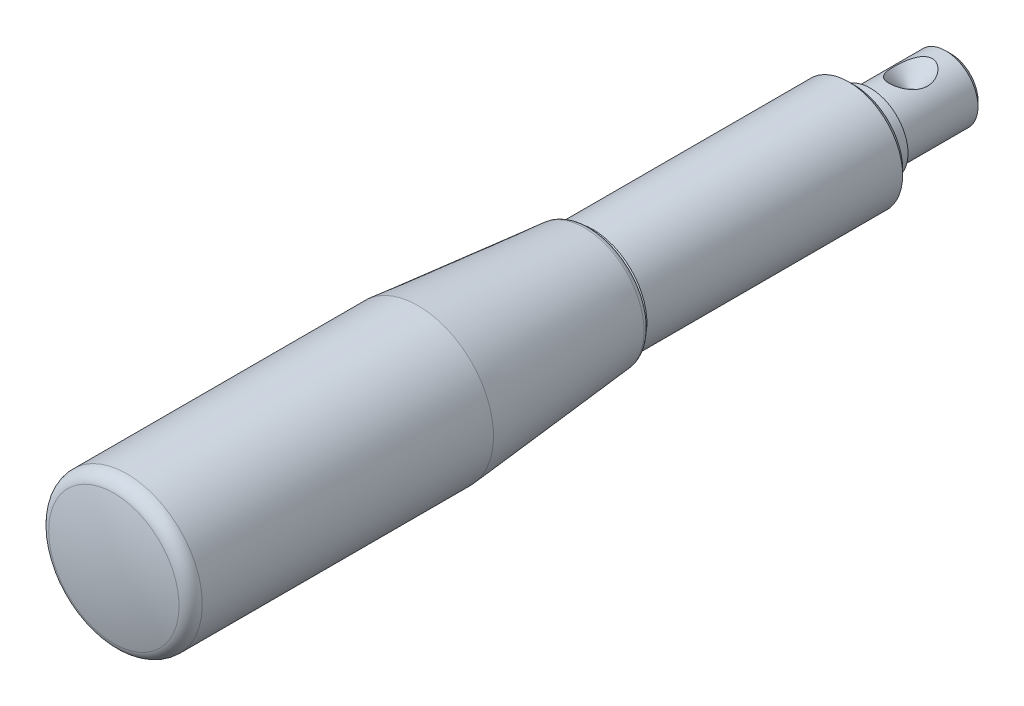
ISO-10303-21;
HEADER;
FILE_DESCRIPTION(('STEP AP214'),'2;1');
FILE_NAME('part.step','',(''),(''),'','','');
FILE_SCHEMA(('AUTOMOTIVE_DESIGN { 1 0 10303 214 1 1 1 1 }'));
ENDSEC;
DATA;
#1=APPLICATION_CONTEXT('core data for automotive mechanical design processes');
#2=APPLICATION_PROTOCOL_DEFINITION('international standard','automotive_design',2000,#1);
#3=PRODUCT_CONTEXT('',#1,'mechanical');
#4=PRODUCT('Part','Part','',(#3));
#5=PRODUCT_RELATED_PRODUCT_CATEGORY('part','',(#4));
#6=PRODUCT_DEFINITION_FORMATION('','',#4);
#7=PRODUCT_DEFINITION_CONTEXT('part definition',#1,'design');
#8=PRODUCT_DEFINITION('design','',#6,#7);
#9=PRODUCT_DEFINITION_SHAPE('','',#8);
#10=(LENGTH_UNIT() NAMED_UNIT(*) SI_UNIT(.MILLI.,.METRE.));
#11=(NAMED_UNIT(*) PLANE_ANGLE_UNIT() SI_UNIT($,.RADIAN.));
#12=(NAMED_UNIT(*) SI_UNIT($,.STERADIAN.) SOLID_ANGLE_UNIT());
#13=UNCERTAINTY_MEASURE_WITH_UNIT(LENGTH_MEASURE(1.E-05),#10,'distance_accuracy_value','');
#14=(GEOMETRIC_REPRESENTATION_CONTEXT(3) GLOBAL_UNCERTAINTY_ASSIGNED_CONTEXT((#13)) GLOBAL_UNIT_ASSIGNED_CONTEXT((#10,
#11,#12)) REPRESENTATION_CONTEXT('',''));
#15=CARTESIAN_POINT('',(0.,0.,0.));
#16=DIRECTION('',(0.,0.,1.));
#17=DIRECTION('',(1.,0.,0.));
#18=AXIS2_PLACEMENT_3D('',#15,#16,#17);
#19=CARTESIAN_POINT('',(0.,0.,51.5));
#20=DIRECTION('',(0.,0.,-1.));
#21=DIRECTION('',(-1.,0.,0.));
#22=AXIS2_PLACEMENT_3D('',#19,#20,#21);
#23=CONICAL_SURFACE('',#22,10.,0.785398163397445);
#24=CARTESIAN_POINT('',(0.,0.,52.));
#25=DIRECTION('',(0.,0.,1.));
#26=DIRECTION('',(-1.,0.,0.));
#27=AXIS2_PLACEMENT_3D('',#24,#25,#26);
#28=CIRCLE('',#27,9.5);
#29=CARTESIAN_POINT('',(-9.5,0.,52.));
#30=VERTEX_POINT('',#29);
#31=EDGE_CURVE('E8',#30,#30,#28,.T.);
#32=ORIENTED_EDGE('',*,*,#31,.F.);
#33=EDGE_LOOP('',(#32));
#34=FACE_BOUND('',#33,.T.);
#35=CARTESIAN_POINT('',(0.,0.,51.5));
#36=DIRECTION('',(0.,0.,-1.));
#37=DIRECTION('',(-1.,0.,0.));
#38=AXIS2_PLACEMENT_3D('',#35,#36,#37);
#39=CIRCLE('',#38,10.);
#40=CARTESIAN_POINT('',(-10.,0.,51.5));
#41=VERTEX_POINT('',#40);
#42=EDGE_CURVE('E54',#41,#41,#39,.T.);
#43=ORIENTED_EDGE('',*,*,#42,.F.);
#44=EDGE_LOOP('',(#43));
#45=FACE_BOUND('',#44,.T.);
#46=ADVANCED_FACE('F12',(#34,#45),#23,.T.);
#47=CARTESIAN_POINT('',(0.,0.,-15.));
#48=DIRECTION('',(0.,0.,-1.));
#49=DIRECTION('',(-1.,0.,0.));
#50=AXIS2_PLACEMENT_3D('',#47,#48,#49);
#51=CYLINDRICAL_SURFACE('',#50,10.);
#52=CARTESIAN_POINT('',(0.,0.,4.));
#53=DIRECTION('',(0.,0.,1.));
#54=DIRECTION('',(1.,0.,0.));
#55=AXIS2_PLACEMENT_3D('',#52,#53,#54);
#56=CIRCLE('',#55,10.);
#57=CARTESIAN_POINT('',(10.,0.,4.));
#58=VERTEX_POINT('',#57);
#59=EDGE_CURVE('E16',#58,#58,#56,.T.);
#60=ORIENTED_EDGE('',*,*,#59,.T.);
#61=EDGE_LOOP('',(#60));
#62=FACE_BOUND('',#61,.T.);
#63=ORIENTED_EDGE('',*,*,#42,.T.);
#64=EDGE_LOOP('',(#63));
#65=FACE_BOUND('',#64,.T.);
#66=ADVANCED_FACE('F74',(#62,#65),#51,.T.);
#67=CARTESIAN_POINT('',(0.,0.,3.));
#68=DIRECTION('',(0.,0.,1.));
#69=DIRECTION('',(1.,0.,0.));
#70=AXIS2_PLACEMENT_3D('',#67,#68,#69);
#71=CONICAL_SURFACE('',#70,9.,0.785398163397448);
#72=ORIENTED_EDGE('',*,*,#59,.F.);
#73=EDGE_LOOP('',(#72));
#74=FACE_BOUND('',#73,.T.);
#75=CARTESIAN_POINT('',(0.,0.,3.));
#76=DIRECTION('',(0.,0.,1.));
#77=DIRECTION('',(1.,0.,0.));
#78=AXIS2_PLACEMENT_3D('',#75,#76,#77);
#79=CIRCLE('',#78,9.);
#80=CARTESIAN_POINT('',(9.,0.,3.));
#81=VERTEX_POINT('',#80);
#82=EDGE_CURVE('E137',#81,#81,#79,.F.);
#83=ORIENTED_EDGE('',*,*,#82,.F.);
#84=EDGE_LOOP('',(#83));
#85=FACE_BOUND('',#84,.T.);
#86=ADVANCED_FACE('F77',(#74,#85),#71,.T.);
#87=CARTESIAN_POINT('',(0.,7.,3.));
#88=DIRECTION('',(0.,0.,1.));
#89=DIRECTION('',(1.,0.,0.));
#90=AXIS2_PLACEMENT_3D('',#87,#88,#89);
#91=PLANE('',#90);
#92=ORIENTED_EDGE('',*,*,#82,.T.);
#93=EDGE_LOOP('',(#92));
#94=FACE_BOUND('',#93,.T.);
#95=CARTESIAN_POINT('',(0.,0.,3.));
#96=DIRECTION('',(0.,0.,-1.));
#97=DIRECTION('',(-1.,0.,0.));
#98=AXIS2_PLACEMENT_3D('',#95,#96,#97);
#99=CIRCLE('',#98,7.);
#100=CARTESIAN_POINT('',(-7.,0.,3.));
#101=VERTEX_POINT('',#100);
#102=EDGE_CURVE('E32',#101,#101,#99,.T.);
#103=ORIENTED_EDGE('',*,*,#102,.F.);
#104=EDGE_LOOP('',(#103));
#105=FACE_BOUND('',#104,.T.);
#106=ADVANCED_FACE('F79',(#94,#105),#91,.F.);
#107=CARTESIAN_POINT('',(0.,0.,-15.));
#108=DIRECTION('',(0.,0.,-1.));
#109=DIRECTION('',(-1.,0.,0.));
#110=AXIS2_PLACEMENT_3D('',#107,#108,#109);
#111=CYLINDRICAL_SURFACE('',#110,7.);
#112=CARTESIAN_POINT('',(0.,0.,0.));
#113=DIRECTION('',(0.,0.,-1.));
#114=DIRECTION('',(-1.,0.,0.));
#115=AXIS2_PLACEMENT_3D('',#112,#113,#114);
#116=CIRCLE('',#115,7.);
#117=CARTESIAN_POINT('',(-7.,0.,0.));
#118=VERTEX_POINT('',#117);
#119=EDGE_CURVE('E35',#118,#118,#116,.T.);
#120=ORIENTED_EDGE('',*,*,#119,.F.);
#121=EDGE_LOOP('',(#120));
#122=FACE_BOUND('',#121,.T.);
#123=ORIENTED_EDGE('',*,*,#102,.T.);
#124=EDGE_LOOP('',(#123));
#125=FACE_BOUND('',#124,.T.);
#126=ADVANCED_FACE('F82',(#122,#125),#111,.T.);
#127=CARTESIAN_POINT('',(0.,6.,0.));
#128=DIRECTION('',(0.,0.,1.));
#129=DIRECTION('',(1.,0.,0.));
#130=AXIS2_PLACEMENT_3D('',#127,#128,#129);
#131=PLANE('',#130);
#132=CARTESIAN_POINT('',(0.,0.,0.));
#133=DIRECTION('',(0.,0.,-1.));
#134=DIRECTION('',(-1.,0.,0.));
#135=AXIS2_PLACEMENT_3D('',#132,#133,#134);
#136=CIRCLE('',#135,6.);
#137=CARTESIAN_POINT('',(-6.,0.,0.));
#138=VERTEX_POINT('',#137);
#139=EDGE_CURVE('E38',#138,#138,#136,.T.);
#140=ORIENTED_EDGE('',*,*,#139,.F.);
#141=EDGE_LOOP('',(#140));
#142=FACE_BOUND('',#141,.T.);
#143=ORIENTED_EDGE('',*,*,#119,.T.);
#144=EDGE_LOOP('',(#143));
#145=FACE_BOUND('',#144,.T.);
#146=ADVANCED_FACE('F85',(#142,#145),#131,.F.);
#147=CARTESIAN_POINT('',(0.,0.,-15.));
#148=DIRECTION('',(0.,0.,-1.));
#149=DIRECTION('',(-1.,0.,0.));
#150=AXIS2_PLACEMENT_3D('',#147,#148,#149);
#151=CYLINDRICAL_SURFACE('',#150,6.);
#152=ORIENTED_EDGE('',*,*,#139,.T.);
#153=EDGE_LOOP('',(#152));
#154=FACE_BOUND('',#153,.T.);
#155=CARTESIAN_POINT('',(0.,0.,-14.));
#156=DIRECTION('',(0.,0.,1.));
#157=DIRECTION('',(1.,0.,0.));
#158=AXIS2_PLACEMENT_3D('',#155,#156,#157);
#159=CIRCLE('',#158,6.);
#160=CARTESIAN_POINT('',(6.,0.,-14.));
#161=VERTEX_POINT('',#160);
#162=EDGE_CURVE('E44',#161,#161,#159,.T.);
#163=ORIENTED_EDGE('',*,*,#162,.T.);
#164=EDGE_LOOP('',(#163));
#165=FACE_BOUND('',#164,.T.);
#166=CARTESIAN_POINT('',(2.06147021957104,5.63474405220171,-10.4936106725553));
#167=CARTESIAN_POINT('',(1.94537926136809,5.67721716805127,-10.6251270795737));
#168=CARTESIAN_POINT('',(1.81952938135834,5.71921045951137,-10.7482867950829));
#169=CARTESIAN_POINT('',(1.54830243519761,5.79850237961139,-10.9728526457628));
#170=CARTESIAN_POINT('',(1.40294833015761,5.83580643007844,-11.0742840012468));
#171=CARTESIAN_POINT('',(1.13034003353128,5.89380613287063,-11.2285247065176));
#172=CARTESIAN_POINT('',(1.00678796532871,5.91634588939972,-11.2871571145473));
#173=CARTESIAN_POINT('',(0.751034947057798,5.95420838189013,-11.3845886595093));
#174=CARTESIAN_POINT('',(0.618842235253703,5.96953788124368,-11.4234063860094));
#175=CARTESIAN_POINT('',(0.348215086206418,5.99143199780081,-11.478608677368));
#176=CARTESIAN_POINT('',(0.209747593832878,5.9979427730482,-11.4948554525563));
#177=CARTESIAN_POINT('',(-0.0680197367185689,6.00122024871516,-11.5030519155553));
#178=CARTESIAN_POINT('',(-0.207319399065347,5.99798893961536,-11.4950065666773));
#179=CARTESIAN_POINT('',(-0.469445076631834,5.98291816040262,-11.4571641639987));
#180=CARTESIAN_POINT('',(-0.59262159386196,5.97188362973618,-11.4294001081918));
#181=CARTESIAN_POINT('',(-0.832760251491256,5.94316091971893,-11.3562416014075));
#182=CARTESIAN_POINT('',(-0.949719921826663,5.92547011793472,-11.3108402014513));
#183=CARTESIAN_POINT('',(-1.21214938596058,5.87824552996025,-11.1875521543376));
#184=CARTESIAN_POINT('',(-1.35455349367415,5.84673153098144,-11.1039047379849));
#185=CARTESIAN_POINT('',(-1.62301608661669,5.77798695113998,-10.9153838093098));
#186=CARTESIAN_POINT('',(-1.74904111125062,5.74074499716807,-10.8104679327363));
#187=CARTESIAN_POINT('',(-2.02193803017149,5.65141451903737,-10.5477020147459));
#188=CARTESIAN_POINT('',(-2.1625345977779,5.59839489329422,-10.3836662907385));
#189=CARTESIAN_POINT('',(-2.41482179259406,5.49429677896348,-10.0342746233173));
#190=CARTESIAN_POINT('',(-2.52648419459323,5.44322022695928,-9.84889811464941));
#191=CARTESIAN_POINT('',(-2.72331769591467,5.34749725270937,-9.45847220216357));
#192=CARTESIAN_POINT('',(-2.80794882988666,5.30299043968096,-9.25311744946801));
#193=CARTESIAN_POINT('',(-2.94771627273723,5.22660210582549,-8.83037053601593));
#194=CARTESIAN_POINT('',(-3.00286542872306,5.19471508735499,-8.61298366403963));
#195=CARTESIAN_POINT('',(-3.06529311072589,5.15796410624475,-8.26950199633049));
#196=CARTESIAN_POINT('',(-3.08295353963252,5.14738887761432,-8.14579741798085));
#197=CARTESIAN_POINT('',(-3.10896001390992,5.131726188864,-7.89703169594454));
#198=CARTESIAN_POINT('',(-3.1173054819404,5.12663906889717,-7.77197046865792));
#199=CARTESIAN_POINT('',(-3.12462160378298,5.12218263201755,-7.52148975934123));
#200=CARTESIAN_POINT('',(-3.12359315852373,5.12281276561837,-7.39607031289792));
#201=CARTESIAN_POINT('',(-3.11217336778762,5.12975841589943,-7.14582248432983));
#202=CARTESIAN_POINT('',(-3.10178234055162,5.13607373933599,-7.02099408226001));
#203=CARTESIAN_POINT('',(-3.07218852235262,5.15382830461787,-6.77693746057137));
#204=CARTESIAN_POINT('',(-3.05328675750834,5.16509220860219,-6.65766007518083));
#205=CARTESIAN_POINT('',(-3.00686932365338,5.19224858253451,-6.42132711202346));
#206=CARTESIAN_POINT('',(-2.97935042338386,5.20814278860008,-6.30427238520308));
#207=CARTESIAN_POINT('',(-2.88389914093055,5.26199320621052,-5.957309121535));
#208=CARTESIAN_POINT('',(-2.80307966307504,5.30611223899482,-5.73166354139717));
#209=CARTESIAN_POINT('',(-2.65506099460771,5.38087131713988,-5.40349202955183));
#210=CARTESIAN_POINT('',(-2.60023356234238,5.40768577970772,-5.29428155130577));
#211=CARTESIAN_POINT('',(-2.48153403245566,5.46317610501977,-5.08139350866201));
#212=CARTESIAN_POINT('',(-2.41766114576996,5.49185213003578,-4.97771642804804));
#213=CARTESIAN_POINT('',(-2.21246621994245,5.57916617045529,-4.6767269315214));
#214=CARTESIAN_POINT('',(-2.05727103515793,5.63925203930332,-4.48878358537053));
#215=CARTESIAN_POINT('',(-1.76960154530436,5.73435969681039,-4.20790207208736));
#216=CARTESIAN_POINT('',(-1.64770371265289,5.77088792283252,-4.10453373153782));
#217=CARTESIAN_POINT('',(-1.38819745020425,5.8387332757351,-3.91767011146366));
#218=CARTESIAN_POINT('',(-1.25061556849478,5.87005899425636,-3.83414196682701));
#219=CARTESIAN_POINT('',(-0.986314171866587,5.91963068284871,-3.70421286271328));
#220=CARTESIAN_POINT('',(-0.86177593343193,5.93919831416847,-3.65390190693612));
#221=CARTESIAN_POINT('',(-0.605405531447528,5.9707714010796,-3.57338945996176));
#222=CARTESIAN_POINT('',(-0.473578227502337,5.98278183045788,-3.54317474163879));
#223=CARTESIAN_POINT('',(-0.205565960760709,5.99798456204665,-3.50500812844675));
#224=CARTESIAN_POINT('',(-0.069363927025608,6.00113657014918,-3.49715796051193));
#225=CARTESIAN_POINT('',(0.202285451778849,5.9981272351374,-3.50468267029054));
#226=CARTESIAN_POINT('',(0.337732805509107,5.99196599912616,-3.52005728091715));
#227=CARTESIAN_POINT('',(0.593984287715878,5.97181215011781,-3.57084951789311));
#228=CARTESIAN_POINT('',(0.715142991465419,5.95841093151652,-3.60475558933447));
#229=CARTESIAN_POINT('',(0.950499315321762,5.92542833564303,-3.6893663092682));
#230=CARTESIAN_POINT('',(1.06469410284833,5.9058444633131,-3.74007774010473));
#231=CARTESIAN_POINT('',(1.32633534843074,5.85361082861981,-3.87789841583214));
#232=CARTESIAN_POINT('',(1.46992804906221,5.81882392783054,-3.9715161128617));
#233=CARTESIAN_POINT('',(1.73916518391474,5.74412210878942,-4.18013563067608));
#234=CARTESIAN_POINT('',(1.86476979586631,5.70419617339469,-4.29518363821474));
#235=CARTESIAN_POINT('',(2.13415284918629,5.60995918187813,-4.58042886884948));
#236=CARTESIAN_POINT('',(2.27135846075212,5.55504935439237,-4.75662892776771));
#237=CARTESIAN_POINT('',(2.515102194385,5.44903145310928,-5.12996296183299));
#238=CARTESIAN_POINT('',(2.62161483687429,5.39792656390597,-5.32711414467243));
#239=CARTESIAN_POINT('',(2.80590536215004,5.30450437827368,-5.7403787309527));
#240=CARTESIAN_POINT('',(2.88320422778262,5.26233817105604,-5.95674189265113));
#241=CARTESIAN_POINT('',(2.97549046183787,5.210341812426,-6.28932711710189));
#242=CARTESIAN_POINT('',(3.00231071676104,5.19488396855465,-6.4015433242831));
#243=CARTESIAN_POINT('',(3.04801412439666,5.16820289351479,-6.62806490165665));
#244=CARTESIAN_POINT('',(3.06689994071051,5.15697824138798,-6.74236955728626));
#245=CARTESIAN_POINT('',(3.0977572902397,5.13850635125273,-6.98083762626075));
#246=CARTESIAN_POINT('',(3.10911804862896,5.13161241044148,-7.10510776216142));
#247=CARTESIAN_POINT('',(3.12254643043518,5.12345257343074,-7.35434087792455));
#248=CARTESIAN_POINT('',(3.12461358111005,5.1221869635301,-7.47930389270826));
#249=CARTESIAN_POINT('',(3.11943868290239,5.125340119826,-7.72903714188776));
#250=CARTESIAN_POINT('',(3.11219126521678,5.12976216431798,-7.85380722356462));
#251=CARTESIAN_POINT('',(3.08842266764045,5.14410696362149,-8.10213246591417));
#252=CARTESIAN_POINT('',(3.07190181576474,5.15402952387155,-8.22568766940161));
#253=CARTESIAN_POINT('',(3.03029279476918,5.17859944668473,-8.4670687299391));
#254=CARTESIAN_POINT('',(3.00547290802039,5.19309814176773,-8.58495588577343));
#255=CARTESIAN_POINT('',(2.94726799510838,5.22634885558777,-8.81799553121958));
#256=CARTESIAN_POINT('',(2.91387925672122,5.24510271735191,-8.93314681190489));
#257=CARTESIAN_POINT('',(2.80103557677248,5.3067535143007,-9.27313714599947));
#258=CARTESIAN_POINT('',(2.70882184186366,5.35509218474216,-9.49298755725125));
#259=CARTESIAN_POINT('',(2.52578065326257,5.44307926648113,-9.84515798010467));
#260=CARTESIAN_POINT('',(2.44405294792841,5.48051978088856,-9.98288174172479));
#261=CARTESIAN_POINT('',(2.26473688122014,5.55702063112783,-10.2472495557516));
#262=CARTESIAN_POINT('',(2.1671468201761,5.59608114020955,-10.3738924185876));
#263=CARTESIAN_POINT('',(2.06147021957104,5.63474405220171,-10.4936106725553));
#264=B_SPLINE_CURVE_WITH_KNOTS('',3,(#166,#167,#168,#169,#170,#171,#172,#173,#174,#175,#176,
#177,#178,#179,#180,#181,#182,#183,#184,#185,#186,#187,#188,#189,#190,#191,#192,#193,#194,#195,
#196,#197,#198,#199,#200,#201,#202,#203,#204,#205,#206,#207,#208,#209,#210,#211,#212,#213,#214,
#215,#216,#217,#218,#219,#220,#221,#222,#223,#224,#225,#226,#227,#228,#229,#230,#231,#232,#233,
#234,#235,#236,#237,#238,#239,#240,#241,#242,#243,#244,#245,#246,#247,#248,#249,#250,#251,#252,
#253,#254,#255,#256,#257,#258,#259,#260,#261,#262,#263),.UNSPECIFIED.,.T.,.F.,(4,2,2,2,2,2,2,2,
2,2,2,2,2,2,2,2,2,2,2,2,2,2,2,2,2,2,2,2,2,2,2,2,2,2,2,2,2,2,2,2,2,2,2,2,2,2,2,2,4),(0.,
0.54103950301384,1.08144757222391,1.49563323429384,1.90942960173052,2.32574114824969,
2.74196764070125,3.12055118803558,3.49928404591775,4.00092641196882,4.50357798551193,
5.16742517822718,5.83191753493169,6.50895565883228,7.18569851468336,7.56150847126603,
7.93734171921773,8.31313884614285,8.68892319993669,9.05234932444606,9.4159118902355,
10.1432229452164,10.5181607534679,10.8931312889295,11.6408422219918,12.1310980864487,
12.6205360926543,13.026068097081,13.4313329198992,13.8384382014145,14.2455388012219,
14.6235338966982,15.0016817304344,15.5235233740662,16.0465029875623,16.7327929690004,
17.4196510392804,18.1173276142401,18.4662522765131,18.8150597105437,19.1895242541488,
19.5640078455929,19.9387073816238,20.3133936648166,20.676980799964,21.0407257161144,
21.766778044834,22.2592288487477,22.7517324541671),.UNSPECIFIED.);
#265=CARTESIAN_POINT('',(2.06147021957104,5.63474405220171,-10.4936106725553));
#266=VERTEX_POINT('',#265);
#267=EDGE_CURVE('E47',#266,#266,#264,.T.);
#268=ORIENTED_EDGE('',*,*,#267,.F.);
#269=EDGE_LOOP('',(#268));
#270=FACE_BOUND('',#269,.T.);
#271=ADVANCED_FACE('F55',(#154,#165,#270),#151,.T.);
#272=CARTESIAN_POINT('',(0.,0.,-15.));
#273=DIRECTION('',(0.,0.,1.));
#274=DIRECTION('',(1.,0.,0.));
#275=AXIS2_PLACEMENT_3D('',#272,#273,#274);
#276=CONICAL_SURFACE('',#275,5.,0.785398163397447);
#277=ORIENTED_EDGE('',*,*,#162,.F.);
#278=EDGE_LOOP('',(#277));
#279=FACE_BOUND('',#278,.T.);
#280=CARTESIAN_POINT('',(0.,0.,-15.));
#281=DIRECTION('',(0.,0.,1.));
#282=DIRECTION('',(1.,0.,0.));
#283=AXIS2_PLACEMENT_3D('',#280,#281,#282);
#284=CIRCLE('',#283,5.);
#285=CARTESIAN_POINT('',(5.,0.,-15.));
#286=VERTEX_POINT('',#285);
#287=EDGE_CURVE('E41',#286,#286,#284,.F.);
#288=ORIENTED_EDGE('',*,*,#287,.F.);
#289=EDGE_LOOP('',(#288));
#290=FACE_BOUND('',#289,.T.);
#291=ADVANCED_FACE('F63',(#279,#290),#276,.T.);
#292=CARTESIAN_POINT('',(0.,2.7071067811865,-7.5));
#293=DIRECTION('',(0.,1.,0.));
#294=DIRECTION('',(-1.,0.,0.));
#295=AXIS2_PLACEMENT_3D('',#292,#293,#294);
#296=CONICAL_SURFACE('',#295,0.707106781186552,0.785398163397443);
#297=CARTESIAN_POINT('',(0.,2.7071067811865,-7.5));
#298=DIRECTION('',(0.,1.,0.));
#299=DIRECTION('',(-1.,0.,0.));
#300=AXIS2_PLACEMENT_3D('',#297,#298,#299);
#301=CIRCLE('',#300,0.707106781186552);
#302=CARTESIAN_POINT('',(-0.707106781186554,2.7071067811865,-7.5));
#303=VERTEX_POINT('',#302);
#304=EDGE_CURVE('E29',#303,#303,#301,.T.);
#305=ORIENTED_EDGE('',*,*,#304,.F.);
#306=EDGE_LOOP('',(#305));
#307=FACE_BOUND('',#306,.T.);
#308=ORIENTED_EDGE('',*,*,#267,.T.);
#309=EDGE_LOOP('',(#308));
#310=FACE_BOUND('',#309,.T.);
#311=ADVANCED_FACE('F58',(#307,#310),#296,.F.);
#312=CARTESIAN_POINT('',(0.,0.,-15.));
#313=DIRECTION('',(0.,0.,1.));
#314=DIRECTION('',(1.,0.,0.));
#315=AXIS2_PLACEMENT_3D('',#312,#313,#314);
#316=PLANE('',#315);
#317=ORIENTED_EDGE('',*,*,#287,.T.);
#318=EDGE_LOOP('',(#317));
#319=FACE_BOUND('',#318,.T.);
#320=ADVANCED_FACE('F14',(#319),#316,.F.);
#321=CARTESIAN_POINT('',(0.,3.41421356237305,-7.5));
#322=DIRECTION('',(0.,1.,0.));
#323=DIRECTION('',(0.,0.,1.));
#324=AXIS2_PLACEMENT_3D('',#321,#322,#323);
#325=SPHERICAL_SURFACE('',#324,1.);
#326=ORIENTED_EDGE('',*,*,#304,.T.);
#327=EDGE_LOOP('',(#326));
#328=FACE_BOUND('',#327,.T.);
#329=ADVANCED_FACE('F65',(#328),#325,.F.);
#330=CARTESIAN_POINT('',(-8.89502802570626,4.25813675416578,52.));
#331=DIRECTION('',(0.,0.,1.));
#332=DIRECTION('',(0.431784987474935,0.901976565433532,0.));
#333=AXIS2_PLACEMENT_3D('',#330,#331,#332);
#334=PLANE('',#333);
#335=ORIENTED_EDGE('',*,*,#31,.T.);
#336=EDGE_LOOP('',(#335));
#337=FACE_BOUND('',#336,.T.);
#338=CARTESIAN_POINT('',(4.78981358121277E-13,0.,52.));
#339=DIRECTION('',(0.,0.,-1.));
#340=DIRECTION('',(-0.431784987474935,-0.901976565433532,0.));
#341=AXIS2_PLACEMENT_3D('',#338,#339,#340);
#342=CIRCLE('',#341,9.86170635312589);
#343=CARTESIAN_POINT('',(-4.25813675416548,-8.89502802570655,52.));
#344=VERTEX_POINT('',#343);
#345=EDGE_CURVE('E143',#344,#344,#342,.T.);
#346=ORIENTED_EDGE('',*,*,#345,.T.);
#347=EDGE_LOOP('',(#346));
#348=FACE_BOUND('',#347,.T.);
#349=ADVANCED_FACE('F69',(#337,#348),#334,.F.);
#350=CARTESIAN_POINT('',(4.41650108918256E-13,0.,53.25));
#351=DIRECTION('',(0.,0.,-1.));
#352=DIRECTION('',(-0.431784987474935,-0.901976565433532,0.));
#353=AXIS2_PLACEMENT_3D('',#350,#351,#352);
#354=TOROIDAL_SURFACE('',#353,9.86170635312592,1.25);
#355=ORIENTED_EDGE('',*,*,#345,.F.);
#356=EDGE_LOOP('',(#355));
#357=FACE_BOUND('',#356,.T.);
#358=CARTESIAN_POINT('',(4.55126334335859E-13,0.,53.1333241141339));
#359=DIRECTION('',(0.,0.,-1.));
#360=DIRECTION('',(-0.431784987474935,-0.901976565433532,0.));
#361=AXIS2_PLACEMENT_3D('',#358,#359,#360);
#362=CIRCLE('',#361,11.1062491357);
#363=CARTESIAN_POINT('',(-4.79551164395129,-10.0175764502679,53.1333241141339));
#364=VERTEX_POINT('',#363);
#365=EDGE_CURVE('E147',#364,#364,#362,.T.);
#366=ORIENTED_EDGE('',*,*,#365,.T.);
#367=EDGE_LOOP('',(#366));
#368=FACE_BOUND('',#367,.T.);
#369=ADVANCED_FACE('F113',(#357,#368),#354,.T.);
#370=CARTESIAN_POINT('',(5.33604330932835E-13,0.,84.));
#371=DIRECTION('',(0.,0.,1.));
#372=DIRECTION('',(0.431784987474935,0.901976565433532,0.));
#373=AXIS2_PLACEMENT_3D('',#370,#371,#372);
#374=CONICAL_SURFACE('',#373,14.,0.0934767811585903);
#375=ORIENTED_EDGE('',*,*,#365,.F.);
#376=EDGE_LOOP('',(#375));
#377=FACE_BOUND('',#376,.T.);
#378=CARTESIAN_POINT('',(5.33604330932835E-13,0.,84.));
#379=DIRECTION('',(0.,0.,-1.));
#380=DIRECTION('',(-0.431784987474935,-0.901976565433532,0.));
#381=AXIS2_PLACEMENT_3D('',#378,#379,#380);
#382=CIRCLE('',#381,14.);
#383=CARTESIAN_POINT('',(-6.04498982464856,-12.6276719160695,84.));
#384=VERTEX_POINT('',#383);
#385=EDGE_CURVE('E25',#384,#384,#382,.T.);
#386=ORIENTED_EDGE('',*,*,#385,.T.);
#387=EDGE_LOOP('',(#386));
#388=FACE_BOUND('',#387,.T.);
#389=ADVANCED_FACE('F116',(#377,#388),#374,.T.);
#390=CARTESIAN_POINT('',(4.06261750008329E-13,0.,47.));
#391=DIRECTION('',(0.,0.,-1.));
#392=DIRECTION('',(-0.431784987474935,-0.901976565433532,0.));
#393=AXIS2_PLACEMENT_3D('',#390,#391,#392);
#394=CYLINDRICAL_SURFACE('',#393,14.);
#395=ORIENTED_EDGE('',*,*,#385,.F.);
#396=EDGE_LOOP('',(#395));
#397=FACE_BOUND('',#396,.T.);
#398=CARTESIAN_POINT('',(5.53221206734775E-13,0.,138.086874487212));
#399=DIRECTION('',(0.,0.,-1.));
#400=DIRECTION('',(-0.431784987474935,-0.901976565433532,0.));
#401=AXIS2_PLACEMENT_3D('',#398,#399,#400);
#402=CIRCLE('',#401,14.);
#403=CARTESIAN_POINT('',(-6.04498982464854,-12.6276719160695,138.086874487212));
#404=VERTEX_POINT('',#403);
#405=EDGE_CURVE('E20',#404,#404,#402,.T.);
#406=ORIENTED_EDGE('',*,*,#405,.T.);
#407=EDGE_LOOP('',(#406));
#408=FACE_BOUND('',#407,.T.);
#409=ADVANCED_FACE('F106',(#397,#408),#394,.T.);
#410=CARTESIAN_POINT('',(5.53221206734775E-13,0.,138.086874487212));
#411=DIRECTION('',(0.,0.,-1.));
#412=DIRECTION('',(-0.431784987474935,-0.901976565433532,0.));
#413=AXIS2_PLACEMENT_3D('',#410,#411,#412);
#414=TOROIDAL_SURFACE('',#413,11.5,2.5);
#415=ORIENTED_EDGE('',*,*,#405,.F.);
#416=EDGE_LOOP('',(#415));
#417=FACE_BOUND('',#416,.T.);
#418=CARTESIAN_POINT('',(4.36669369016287E-13,0.,140.512499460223));
#419=DIRECTION('',(0.,0.,-1.));
#420=DIRECTION('',(-0.431784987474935,-0.901976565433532,0.));
#421=AXIS2_PLACEMENT_3D('',#418,#419,#420);
#422=CIRCLE('',#421,12.1052631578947);
#423=CARTESIAN_POINT('',(-5.22687090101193,-10.918663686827,140.512499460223));
#424=VERTEX_POINT('',#423);
#425=EDGE_CURVE('E141',#424,#424,#422,.T.);
#426=ORIENTED_EDGE('',*,*,#425,.T.);
#427=EDGE_LOOP('',(#426));
#428=FACE_BOUND('',#427,.T.);
#429=ADVANCED_FACE('F100',(#417,#428),#414,.T.);
#430=CARTESIAN_POINT('',(4.22359983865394E-13,0.,92.));
#431=DIRECTION('',(-0.431784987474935,-0.901976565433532,0.));
#432=DIRECTION('',(0.,0.,1.));
#433=AXIS2_PLACEMENT_3D('',#430,#431,#432);
#434=SPHERICAL_SURFACE('',#433,50.);
#435=CARTESIAN_POINT('',(4.22359983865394E-13,0.,92.));
#436=DIRECTION('',(0.,0.,-1.));
#437=DIRECTION('',(-0.431784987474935,-0.901976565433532,0.));
#438=AXIS2_PLACEMENT_3D('',#435,#436,#437);
#439=SPHERICAL_SURFACE('',#438,50.);
#440=ORIENTED_EDGE('',*,*,#425,.F.);
#441=EDGE_LOOP('',(#440));
#442=FACE_BOUND('',#441,.T.);
#443=ADVANCED_FACE('F98',(#442),#439,.T.);
#444=CLOSED_SHELL('',(#46,#66,#86,#106,#126,#146,#271,#291,#311,#320,#329,#349,#369,#389,#409,
#429,#443));
#445=MANIFOLD_SOLID_BREP('B1',#444);
#446=ADVANCED_BREP_SHAPE_REPRESENTATION('',(#18,#445),#14);
#447=SHAPE_DEFINITION_REPRESENTATION(#9,#446);
ENDSEC;
END-ISO-10303-21;
